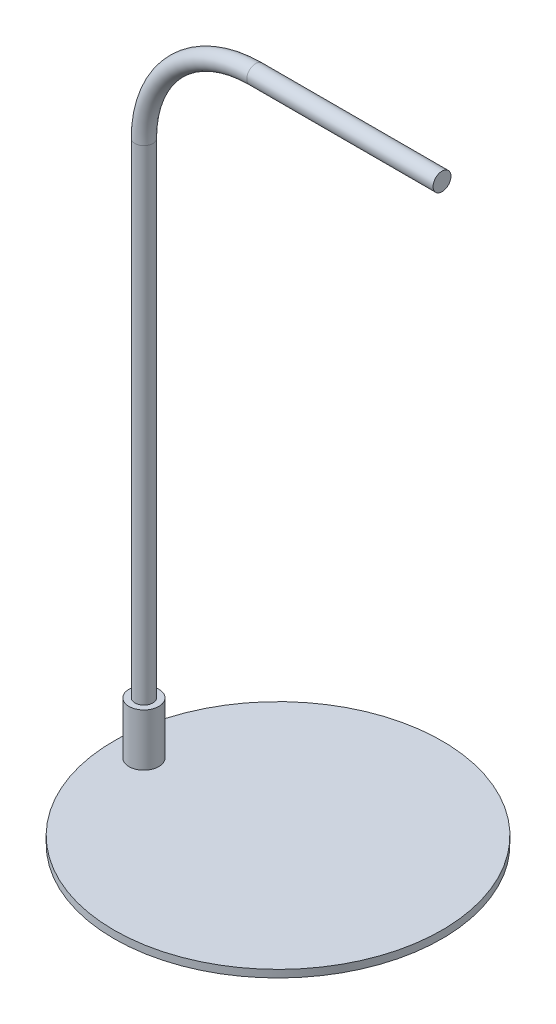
from build123d import *

# Parameters (mm, degrees)
CROQUIS1_R              = 110
SALIENTE_EXTRUIR1_DEPTH = 5
CROQUIS4_R              = 10
SALIENTE_EXTRUIR2_DEPTH = 35
BARRER1_PROFILE_R       = 6


with BuildPart() as part:
    # Croquis1 → Saliente-Extruir1 (new body)
    with BuildSketch(Plane(origin=(0, 0, 0), x_dir=(1, 0, 0), z_dir=(0, 1, 0))):
        with Locations(Location((0, 0, 0), (0, 0, 270))):
            Circle(CROQUIS1_R)
    extrude(amount=SALIENTE_EXTRUIR1_DEPTH)


with BuildPart() as body_2:
    # Croquis4 → Saliente-Extruir2 (new body)
    with BuildSketch(Plane(origin=(0, 5, 0), x_dir=(1, 0, 0), z_dir=(0, 1, 0))):
        with Locations(Location((-90, 0, 0), (0, 0, 270))):
            Circle(CROQUIS4_R)
    extrude(amount=SALIENTE_EXTRUIR2_DEPTH)


with BuildPart() as body_3:
    # Barrer1: sweep along a path in Croquis5
    with BuildLine(Plane.XY) as barrer1_path:
        Line((-90, 40), (-90, 365))
        ThreePointArc((-90, 365), (-68.033008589, 418.033008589), (-15, 440))
        Line((-15, 440), (110, 440))
    # Barrer1 profile (on start of the path) → Barrer1 (sweep)
    with BuildSketch(Plane(origin=(-90, 40, 0), x_dir=(0, 0, 1), z_dir=(0, 1, 0))):
        Circle(BARRER1_PROFILE_R)
    sweep(path=barrer1_path.line)


solid = Compound([part.part, body_2.part, body_3.part])
